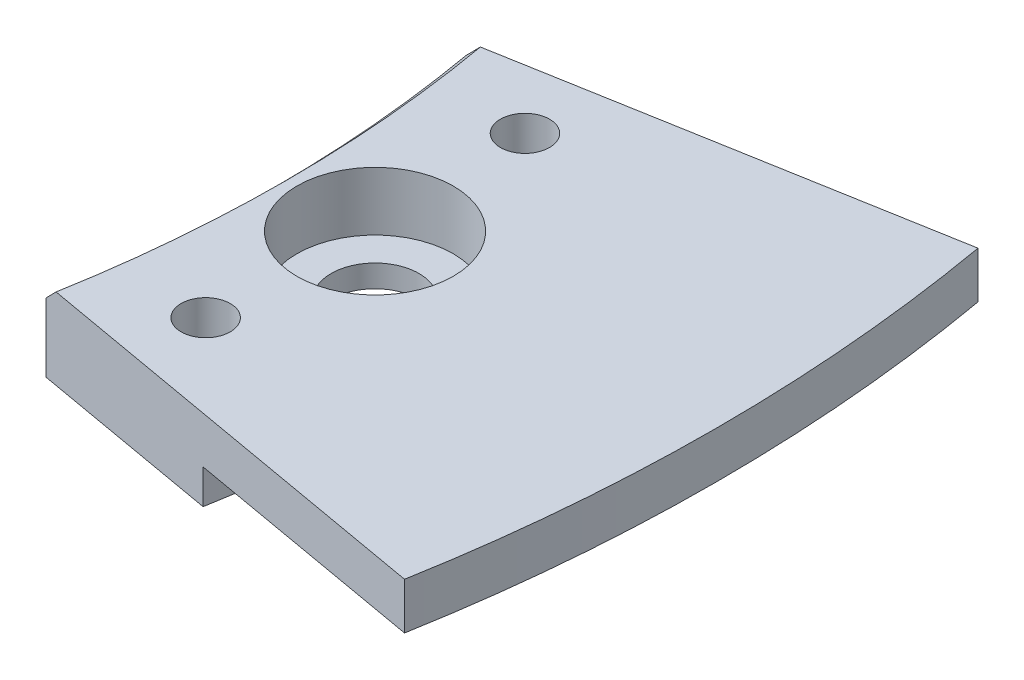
ISO-10303-21;
HEADER;
FILE_DESCRIPTION(('STEP AP214'),'2;1');
FILE_NAME('part.step','',(''),(''),'','','');
FILE_SCHEMA(('AUTOMOTIVE_DESIGN { 1 0 10303 214 1 1 1 1 }'));
ENDSEC;
DATA;
#1=APPLICATION_CONTEXT('core data for automotive mechanical design processes');
#2=APPLICATION_PROTOCOL_DEFINITION('international standard','automotive_design',2000,#1);
#3=PRODUCT_CONTEXT('',#1,'mechanical');
#4=PRODUCT('Part','Part','',(#3));
#5=PRODUCT_RELATED_PRODUCT_CATEGORY('part','',(#4));
#6=PRODUCT_DEFINITION_FORMATION('','',#4);
#7=PRODUCT_DEFINITION_CONTEXT('part definition',#1,'design');
#8=PRODUCT_DEFINITION('design','',#6,#7);
#9=PRODUCT_DEFINITION_SHAPE('','',#8);
#10=(LENGTH_UNIT() NAMED_UNIT(*) SI_UNIT(.MILLI.,.METRE.));
#11=(NAMED_UNIT(*) PLANE_ANGLE_UNIT() SI_UNIT($,.RADIAN.));
#12=(NAMED_UNIT(*) SI_UNIT($,.STERADIAN.) SOLID_ANGLE_UNIT());
#13=UNCERTAINTY_MEASURE_WITH_UNIT(LENGTH_MEASURE(1.E-05),#10,'distance_accuracy_value','');
#14=(GEOMETRIC_REPRESENTATION_CONTEXT(3) GLOBAL_UNCERTAINTY_ASSIGNED_CONTEXT((#13)) GLOBAL_UNIT_ASSIGNED_CONTEXT((#10,
#11,#12)) REPRESENTATION_CONTEXT('',''));
#15=CARTESIAN_POINT('',(0.,0.,0.));
#16=DIRECTION('',(0.,0.,1.));
#17=DIRECTION('',(1.,0.,0.));
#18=AXIS2_PLACEMENT_3D('',#15,#16,#17);
#19=CARTESIAN_POINT('',(60.9093747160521,0.,-10.739966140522));
#20=DIRECTION('',(0.,-1.,0.));
#21=DIRECTION('',(0.,0.,-1.));
#22=AXIS2_PLACEMENT_3D('',#19,#20,#21);
#23=PLANE('',#22);
#24=CARTESIAN_POINT('',(66.5005921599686,0.,8.1652460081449));
#25=DIRECTION('',(0.,1.,0.));
#26=DIRECTION('',(0.,0.,1.));
#27=AXIS2_PLACEMENT_3D('',#24,#25,#26);
#28=CIRCLE('',#27,1.25749999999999);
#29=CARTESIAN_POINT('',(66.5005921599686,0.,9.42274600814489));
#30=VERTEX_POINT('',#29);
#31=EDGE_CURVE('E110',#30,#30,#28,.T.);
#32=ORIENTED_EDGE('',*,*,#31,.T.);
#33=EDGE_LOOP('',(#32));
#34=FACE_BOUND('',#33,.T.);
#35=DIRECTION('',(0.984807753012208,0.,-0.173648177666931));
#36=VECTOR('',#35,1.);
#37=CARTESIAN_POINT('',(60.9093747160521,0.,-10.739966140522));
#38=LINE('',#37,#36);
#39=CARTESIAN_POINT('',(60.9093747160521,0.,-10.739966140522));
#40=VERTEX_POINT('',#39);
#41=CARTESIAN_POINT('',(70.664880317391,0.,-12.4601249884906));
#42=VERTEX_POINT('',#41);
#43=EDGE_CURVE('E140',#40,#42,#38,.T.);
#44=ORIENTED_EDGE('',*,*,#43,.T.);
#45=CARTESIAN_POINT('',(0.,0.,0.));
#46=DIRECTION('',(0.,-1.,0.));
#47=DIRECTION('',(0.,0.,-1.));
#48=AXIS2_PLACEMENT_3D('',#45,#46,#47);
#49=CIRCLE('',#48,71.755);
#50=CARTESIAN_POINT('',(70.664880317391,0.,12.4601249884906));
#51=VERTEX_POINT('',#50);
#52=EDGE_CURVE('E143',#42,#51,#49,.T.);
#53=ORIENTED_EDGE('',*,*,#52,.T.);
#54=DIRECTION('',(0.984807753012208,0.,0.173648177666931));
#55=VECTOR('',#54,1.);
#56=CARTESIAN_POINT('',(60.9093747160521,0.,10.739966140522));
#57=LINE('',#56,#55);
#58=CARTESIAN_POINT('',(60.9093747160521,0.,10.739966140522));
#59=VERTEX_POINT('',#58);
#60=EDGE_CURVE('E109',#59,#51,#57,.T.);
#61=ORIENTED_EDGE('',*,*,#60,.F.);
#62=CARTESIAN_POINT('',(0.,0.,0.));
#63=DIRECTION('',(0.,-1.,0.));
#64=DIRECTION('',(0.,0.,-1.));
#65=AXIS2_PLACEMENT_3D('',#62,#63,#64);
#66=CIRCLE('',#65,61.849);
#67=EDGE_CURVE('E145',#40,#59,#66,.T.);
#68=ORIENTED_EDGE('',*,*,#67,.F.);
#69=EDGE_LOOP('',(#44,#53,#61,#68));
#70=FACE_BOUND('',#69,.T.);
#71=CARTESIAN_POINT('',(66.5005921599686,0.,-8.1652460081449));
#72=DIRECTION('',(0.,-1.,0.));
#73=DIRECTION('',(0.,0.,-1.));
#74=AXIS2_PLACEMENT_3D('',#71,#72,#73);
#75=CIRCLE('',#74,1.25749999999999);
#76=CARTESIAN_POINT('',(66.5005921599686,0.,-9.42274600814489));
#77=VERTEX_POINT('',#76);
#78=EDGE_CURVE('E126',#77,#77,#75,.T.);
#79=ORIENTED_EDGE('',*,*,#78,.F.);
#80=EDGE_LOOP('',(#79));
#81=FACE_BOUND('',#80,.T.);
#82=CARTESIAN_POINT('',(67.,0.,0.));
#83=DIRECTION('',(0.,1.,0.));
#84=DIRECTION('',(0.,0.,1.));
#85=AXIS2_PLACEMENT_3D('',#82,#83,#84);
#86=CIRCLE('',#85,2.25);
#87=CARTESIAN_POINT('',(67.,0.,2.25));
#88=VERTEX_POINT('',#87);
#89=EDGE_CURVE('E314',#88,#88,#86,.T.);
#90=ORIENTED_EDGE('',*,*,#89,.T.);
#91=EDGE_LOOP('',(#90));
#92=FACE_BOUND('',#91,.T.);
#93=ADVANCED_FACE('F30',(#34,#70,#81,#92),#23,.T.);
#94=CARTESIAN_POINT('',(60.9093747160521,4.14325,-10.739966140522));
#95=DIRECTION('',(0.,1.,0.));
#96=DIRECTION('',(0.,0.,1.));
#97=AXIS2_PLACEMENT_3D('',#94,#95,#96);
#98=PLANE('',#97);
#99=CARTESIAN_POINT('',(67.,4.14325,0.));
#100=DIRECTION('',(0.,1.,0.));
#101=DIRECTION('',(0.,0.,1.));
#102=AXIS2_PLACEMENT_3D('',#99,#100,#101);
#103=CIRCLE('',#102,4.);
#104=CARTESIAN_POINT('',(67.,4.14325,4.));
#105=VERTEX_POINT('',#104);
#106=EDGE_CURVE('E323',#105,#105,#103,.T.);
#107=ORIENTED_EDGE('',*,*,#106,.F.);
#108=EDGE_LOOP('',(#107));
#109=FACE_BOUND('',#108,.T.);
#110=DIRECTION('',(-0.984807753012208,0.,0.173648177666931));
#111=VECTOR('',#110,1.);
#112=CARTESIAN_POINT('',(60.9093747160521,4.14325,-10.739966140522));
#113=LINE('',#112,#111);
#114=CARTESIAN_POINT('',(83.171938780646,4.14325,-14.6654568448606));
#115=VERTEX_POINT('',#114);
#116=CARTESIAN_POINT('',(61.5347276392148,4.14324999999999,-10.8502327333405));
#117=VERTEX_POINT('',#116);
#118=EDGE_CURVE('E135',#115,#117,#113,.T.);
#119=ORIENTED_EDGE('',*,*,#118,.T.);
#120=CARTESIAN_POINT('',(0.,4.14325,0.));
#121=DIRECTION('',(0.,1.,0.));
#122=DIRECTION('',(0.,0.,1.));
#123=AXIS2_PLACEMENT_3D('',#120,#121,#122);
#124=CIRCLE('',#123,62.484);
#125=CARTESIAN_POINT('',(61.5347276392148,4.14324999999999,10.8502327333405));
#126=VERTEX_POINT('',#125);
#127=EDGE_CURVE('E97',#117,#126,#124,.F.);
#128=ORIENTED_EDGE('',*,*,#127,.T.);
#129=DIRECTION('',(-0.984807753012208,0.,-0.173648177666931));
#130=VECTOR('',#129,1.);
#131=CARTESIAN_POINT('',(60.9093747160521,4.14325,10.739966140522));
#132=LINE('',#131,#130);
#133=CARTESIAN_POINT('',(83.171938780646,4.14325,14.6654568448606));
#134=VERTEX_POINT('',#133);
#135=EDGE_CURVE('E118',#134,#126,#132,.T.);
#136=ORIENTED_EDGE('',*,*,#135,.F.);
#137=CARTESIAN_POINT('',(0.,4.14325,0.));
#138=DIRECTION('',(0.,-1.,0.));
#139=DIRECTION('',(0.,0.,-1.));
#140=AXIS2_PLACEMENT_3D('',#137,#138,#139);
#141=CIRCLE('',#140,84.455);
#142=EDGE_CURVE('E148',#115,#134,#141,.T.);
#143=ORIENTED_EDGE('',*,*,#142,.F.);
#144=EDGE_LOOP('',(#119,#128,#136,#143));
#145=FACE_BOUND('',#144,.T.);
#146=CARTESIAN_POINT('',(66.5005921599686,4.14325,-8.1652460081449));
#147=DIRECTION('',(0.,-1.,0.));
#148=DIRECTION('',(0.,0.,-1.));
#149=AXIS2_PLACEMENT_3D('',#146,#147,#148);
#150=CIRCLE('',#149,1.25749999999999);
#151=CARTESIAN_POINT('',(66.5005921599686,4.14325,-9.42274600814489));
#152=VERTEX_POINT('',#151);
#153=EDGE_CURVE('E123',#152,#152,#150,.T.);
#154=ORIENTED_EDGE('',*,*,#153,.T.);
#155=EDGE_LOOP('',(#154));
#156=FACE_BOUND('',#155,.T.);
#157=CARTESIAN_POINT('',(66.5005921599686,4.14325,8.1652460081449));
#158=DIRECTION('',(0.,1.,0.));
#159=DIRECTION('',(0.,0.,1.));
#160=AXIS2_PLACEMENT_3D('',#157,#158,#159);
#161=CIRCLE('',#160,1.25749999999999);
#162=CARTESIAN_POINT('',(66.5005921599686,4.14325,9.42274600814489));
#163=VERTEX_POINT('',#162);
#164=EDGE_CURVE('E113',#163,#163,#161,.T.);
#165=ORIENTED_EDGE('',*,*,#164,.F.);
#166=EDGE_LOOP('',(#165));
#167=FACE_BOUND('',#166,.T.);
#168=ADVANCED_FACE('F156',(#109,#145,#156,#167),#98,.T.);
#169=CARTESIAN_POINT('',(0.,0.,0.));
#170=DIRECTION('',(0.,-1.,0.));
#171=DIRECTION('',(0.,0.,-1.));
#172=AXIS2_PLACEMENT_3D('',#169,#170,#171);
#173=CYLINDRICAL_SURFACE('',#172,71.755);
#174=CARTESIAN_POINT('',(0.,1.762,0.));
#175=DIRECTION('',(0.,-1.,0.));
#176=DIRECTION('',(0.,0.,-1.));
#177=AXIS2_PLACEMENT_3D('',#174,#175,#176);
#178=CIRCLE('',#177,71.755);
#179=CARTESIAN_POINT('',(70.664880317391,1.762,-12.4601249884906));
#180=VERTEX_POINT('',#179);
#181=CARTESIAN_POINT('',(70.664880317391,1.762,12.4601249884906));
#182=VERTEX_POINT('',#181);
#183=EDGE_CURVE('E87',#180,#182,#178,.T.);
#184=ORIENTED_EDGE('',*,*,#183,.T.);
#185=DIRECTION('',(0.,1.,0.));
#186=VECTOR('',#185,1.);
#187=CARTESIAN_POINT('',(70.664880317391,1.762,12.4601249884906));
#188=LINE('',#187,#186);
#189=EDGE_CURVE('E91',#51,#182,#188,.T.);
#190=ORIENTED_EDGE('',*,*,#189,.F.);
#191=ORIENTED_EDGE('',*,*,#52,.F.);
#192=DIRECTION('',(0.,1.,0.));
#193=VECTOR('',#192,1.);
#194=CARTESIAN_POINT('',(70.664880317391,1.762,-12.4601249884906));
#195=LINE('',#194,#193);
#196=EDGE_CURVE('E93',#42,#180,#195,.T.);
#197=ORIENTED_EDGE('',*,*,#196,.T.);
#198=EDGE_LOOP('',(#184,#190,#191,#197));
#199=FACE_BOUND('',#198,.T.);
#200=ADVANCED_FACE('F89',(#199),#173,.T.);
#201=CARTESIAN_POINT('',(70.664880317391,1.762,-12.4601249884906));
#202=DIRECTION('',(0.,-1.,0.));
#203=DIRECTION('',(0.,0.,-1.));
#204=AXIS2_PLACEMENT_3D('',#201,#202,#203);
#205=PLANE('',#204);
#206=CARTESIAN_POINT('',(0.,1.762,0.));
#207=DIRECTION('',(0.,-1.,0.));
#208=DIRECTION('',(0.,0.,-1.));
#209=AXIS2_PLACEMENT_3D('',#206,#207,#208);
#210=CIRCLE('',#209,84.455);
#211=CARTESIAN_POINT('',(83.171938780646,1.762,-14.6654568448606));
#212=VERTEX_POINT('',#211);
#213=CARTESIAN_POINT('',(83.171938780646,1.762,14.6654568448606));
#214=VERTEX_POINT('',#213);
#215=EDGE_CURVE('E98',#212,#214,#210,.T.);
#216=ORIENTED_EDGE('',*,*,#215,.T.);
#217=DIRECTION('',(0.984807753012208,0.,0.173648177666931));
#218=VECTOR('',#217,1.);
#219=CARTESIAN_POINT('',(70.664880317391,1.762,12.4601249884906));
#220=LINE('',#219,#218);
#221=EDGE_CURVE('E101',#182,#214,#220,.T.);
#222=ORIENTED_EDGE('',*,*,#221,.F.);
#223=ORIENTED_EDGE('',*,*,#183,.F.);
#224=DIRECTION('',(0.984807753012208,0.,-0.173648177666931));
#225=VECTOR('',#224,1.);
#226=CARTESIAN_POINT('',(70.664880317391,1.762,-12.4601249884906));
#227=LINE('',#226,#225);
#228=EDGE_CURVE('E130',#180,#212,#227,.T.);
#229=ORIENTED_EDGE('',*,*,#228,.T.);
#230=EDGE_LOOP('',(#216,#222,#223,#229));
#231=FACE_BOUND('',#230,.T.);
#232=ADVANCED_FACE('F32',(#231),#205,.T.);
#233=CARTESIAN_POINT('',(0.,0.,0.));
#234=DIRECTION('',(0.,-1.,0.));
#235=DIRECTION('',(0.,0.,-1.));
#236=AXIS2_PLACEMENT_3D('',#233,#234,#235);
#237=CYLINDRICAL_SURFACE('',#236,84.455);
#238=ORIENTED_EDGE('',*,*,#142,.T.);
#239=DIRECTION('',(0.,1.,0.));
#240=VECTOR('',#239,1.);
#241=CARTESIAN_POINT('',(83.171938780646,1.762,14.6654568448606));
#242=LINE('',#241,#240);
#243=EDGE_CURVE('E104',#214,#134,#242,.T.);
#244=ORIENTED_EDGE('',*,*,#243,.F.);
#245=ORIENTED_EDGE('',*,*,#215,.F.);
#246=DIRECTION('',(0.,1.,0.));
#247=VECTOR('',#246,1.);
#248=CARTESIAN_POINT('',(83.171938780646,1.762,-14.6654568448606));
#249=LINE('',#248,#247);
#250=EDGE_CURVE('E132',#212,#115,#249,.T.);
#251=ORIENTED_EDGE('',*,*,#250,.T.);
#252=EDGE_LOOP('',(#238,#244,#245,#251));
#253=FACE_BOUND('',#252,.T.);
#254=ADVANCED_FACE('F162',(#253),#237,.T.);
#255=CARTESIAN_POINT('',(0.,0.,0.));
#256=DIRECTION('',(0.,-1.,0.));
#257=DIRECTION('',(0.,0.,-1.));
#258=AXIS2_PLACEMENT_3D('',#255,#256,#257);
#259=CYLINDRICAL_SURFACE('',#258,61.849);
#260=DIRECTION('',(0.,-1.,0.));
#261=VECTOR('',#260,1.);
#262=CARTESIAN_POINT('',(60.9093747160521,4.14325,10.739966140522));
#263=LINE('',#262,#261);
#264=CARTESIAN_POINT('',(60.9093747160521,3.50824999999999,10.739966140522));
#265=VERTEX_POINT('',#264);
#266=EDGE_CURVE('E120',#265,#59,#263,.T.);
#267=ORIENTED_EDGE('',*,*,#266,.F.);
#268=CARTESIAN_POINT('',(0.,3.50824999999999,0.));
#269=DIRECTION('',(0.,1.,0.));
#270=DIRECTION('',(0.,0.,1.));
#271=AXIS2_PLACEMENT_3D('',#268,#269,#270);
#272=CIRCLE('',#271,61.849);
#273=CARTESIAN_POINT('',(60.909374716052,3.50824999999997,-10.739966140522));
#274=VERTEX_POINT('',#273);
#275=EDGE_CURVE('E38',#265,#274,#272,.T.);
#276=ORIENTED_EDGE('',*,*,#275,.T.);
#277=DIRECTION('',(0.,-1.,0.));
#278=VECTOR('',#277,1.);
#279=CARTESIAN_POINT('',(60.9093747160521,4.14325,-10.739966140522));
#280=LINE('',#279,#278);
#281=EDGE_CURVE('E138',#274,#40,#280,.T.);
#282=ORIENTED_EDGE('',*,*,#281,.T.);
#283=ORIENTED_EDGE('',*,*,#67,.T.);
#284=EDGE_LOOP('',(#267,#276,#282,#283));
#285=FACE_BOUND('',#284,.T.);
#286=ADVANCED_FACE('F189',(#285),#259,.F.);
#287=CARTESIAN_POINT('',(70.664880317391,0.,-12.4601249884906));
#288=DIRECTION('',(0.173648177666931,0.,0.984807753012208));
#289=DIRECTION('',(0.984807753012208,0.,-0.173648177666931));
#290=AXIS2_PLACEMENT_3D('',#287,#288,#289);
#291=PLANE('',#290);
#292=ORIENTED_EDGE('',*,*,#281,.F.);
#293=DIRECTION('',(0.696364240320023,0.707106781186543,-0.122787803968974));
#294=VECTOR('',#293,1.);
#295=CARTESIAN_POINT('',(0.,-58.3407499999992,0.));
#296=LINE('',#295,#294);
#297=EDGE_CURVE('E11',#274,#117,#296,.T.);
#298=ORIENTED_EDGE('',*,*,#297,.T.);
#299=ORIENTED_EDGE('',*,*,#118,.F.);
#300=ORIENTED_EDGE('',*,*,#250,.F.);
#301=ORIENTED_EDGE('',*,*,#228,.F.);
#302=ORIENTED_EDGE('',*,*,#196,.F.);
#303=ORIENTED_EDGE('',*,*,#43,.F.);
#304=EDGE_LOOP('',(#292,#298,#299,#300,#301,#302,#303));
#305=FACE_BOUND('',#304,.T.);
#306=ADVANCED_FACE('F165',(#305),#291,.F.);
#307=CARTESIAN_POINT('',(66.5005921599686,0.,-8.1652460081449));
#308=DIRECTION('',(0.,-1.,0.));
#309=DIRECTION('',(0.,0.,-1.));
#310=AXIS2_PLACEMENT_3D('',#307,#308,#309);
#311=CYLINDRICAL_SURFACE('',#310,1.25749999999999);
#312=ORIENTED_EDGE('',*,*,#153,.F.);
#313=EDGE_LOOP('',(#312));
#314=FACE_BOUND('',#313,.T.);
#315=ORIENTED_EDGE('',*,*,#78,.T.);
#316=EDGE_LOOP('',(#315));
#317=FACE_BOUND('',#316,.T.);
#318=ADVANCED_FACE('F229',(#314,#317),#311,.F.);
#319=CARTESIAN_POINT('',(70.664880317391,0.,12.4601249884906));
#320=DIRECTION('',(0.173648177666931,0.,-0.984807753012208));
#321=DIRECTION('',(0.984807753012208,0.,0.173648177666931));
#322=AXIS2_PLACEMENT_3D('',#319,#320,#321);
#323=PLANE('',#322);
#324=ORIENTED_EDGE('',*,*,#135,.T.);
#325=DIRECTION('',(-0.696364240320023,-0.707106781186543,-0.122787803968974));
#326=VECTOR('',#325,1.);
#327=CARTESIAN_POINT('',(0.,-58.3407499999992,0.));
#328=LINE('',#327,#326);
#329=EDGE_CURVE('E52',#126,#265,#328,.T.);
#330=ORIENTED_EDGE('',*,*,#329,.T.);
#331=ORIENTED_EDGE('',*,*,#266,.T.);
#332=ORIENTED_EDGE('',*,*,#60,.T.);
#333=ORIENTED_EDGE('',*,*,#189,.T.);
#334=ORIENTED_EDGE('',*,*,#221,.T.);
#335=ORIENTED_EDGE('',*,*,#243,.T.);
#336=EDGE_LOOP('',(#324,#330,#331,#332,#333,#334,#335));
#337=FACE_BOUND('',#336,.T.);
#338=ADVANCED_FACE('F107',(#337),#323,.F.);
#339=CARTESIAN_POINT('',(66.5005921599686,0.,8.1652460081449));
#340=DIRECTION('',(0.,-1.,0.));
#341=DIRECTION('',(0.,0.,1.));
#342=AXIS2_PLACEMENT_3D('',#339,#340,#341);
#343=CYLINDRICAL_SURFACE('',#342,1.25749999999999);
#344=ORIENTED_EDGE('',*,*,#164,.T.);
#345=EDGE_LOOP('',(#344));
#346=FACE_BOUND('',#345,.T.);
#347=ORIENTED_EDGE('',*,*,#31,.F.);
#348=EDGE_LOOP('',(#347));
#349=FACE_BOUND('',#348,.T.);
#350=ADVANCED_FACE('F236',(#346,#349),#343,.F.);
#351=CARTESIAN_POINT('',(67.,4.14325,0.));
#352=DIRECTION('',(0.,1.,0.));
#353=DIRECTION('',(0.,0.,1.));
#354=AXIS2_PLACEMENT_3D('',#351,#352,#353);
#355=CYLINDRICAL_SURFACE('',#354,4.);
#356=CARTESIAN_POINT('',(67.,1.14325,0.));
#357=DIRECTION('',(0.,1.,0.));
#358=DIRECTION('',(0.,0.,1.));
#359=AXIS2_PLACEMENT_3D('',#356,#357,#358);
#360=CIRCLE('',#359,4.);
#361=CARTESIAN_POINT('',(67.,1.14325,4.));
#362=VERTEX_POINT('',#361);
#363=EDGE_CURVE('E318',#362,#362,#360,.T.);
#364=ORIENTED_EDGE('',*,*,#363,.F.);
#365=EDGE_LOOP('',(#364));
#366=FACE_BOUND('',#365,.T.);
#367=ORIENTED_EDGE('',*,*,#106,.T.);
#368=EDGE_LOOP('',(#367));
#369=FACE_BOUND('',#368,.T.);
#370=ADVANCED_FACE('F254',(#366,#369),#355,.F.);
#371=CARTESIAN_POINT('',(69.25,1.14325,0.));
#372=DIRECTION('',(0.,-1.,0.));
#373=DIRECTION('',(0.,0.,-1.));
#374=AXIS2_PLACEMENT_3D('',#371,#372,#373);
#375=PLANE('',#374);
#376=CARTESIAN_POINT('',(67.,1.14325,0.));
#377=DIRECTION('',(0.,1.,0.));
#378=DIRECTION('',(0.,0.,1.));
#379=AXIS2_PLACEMENT_3D('',#376,#377,#378);
#380=CIRCLE('',#379,2.25);
#381=CARTESIAN_POINT('',(67.,1.14325,2.25));
#382=VERTEX_POINT('',#381);
#383=EDGE_CURVE('E315',#382,#382,#380,.T.);
#384=ORIENTED_EDGE('',*,*,#383,.F.);
#385=EDGE_LOOP('',(#384));
#386=FACE_BOUND('',#385,.T.);
#387=ORIENTED_EDGE('',*,*,#363,.T.);
#388=EDGE_LOOP('',(#387));
#389=FACE_BOUND('',#388,.T.);
#390=ADVANCED_FACE('F174',(#386,#389),#375,.F.);
#391=CARTESIAN_POINT('',(67.,4.14325,0.));
#392=DIRECTION('',(0.,1.,0.));
#393=DIRECTION('',(0.,0.,1.));
#394=AXIS2_PLACEMENT_3D('',#391,#392,#393);
#395=CYLINDRICAL_SURFACE('',#394,2.25);
#396=ORIENTED_EDGE('',*,*,#89,.F.);
#397=EDGE_LOOP('',(#396));
#398=FACE_BOUND('',#397,.T.);
#399=ORIENTED_EDGE('',*,*,#383,.T.);
#400=EDGE_LOOP('',(#399));
#401=FACE_BOUND('',#400,.T.);
#402=ADVANCED_FACE('F169',(#398,#401),#395,.F.);
#403=CARTESIAN_POINT('',(0.,4.14325,0.));
#404=DIRECTION('',(0.,1.,0.));
#405=DIRECTION('',(0.,0.,1.));
#406=AXIS2_PLACEMENT_3D('',#403,#404,#405);
#407=CONICAL_SURFACE('',#406,62.484,0.785398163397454);
#408=ORIENTED_EDGE('',*,*,#297,.F.);
#409=ORIENTED_EDGE('',*,*,#275,.F.);
#410=ORIENTED_EDGE('',*,*,#329,.F.);
#411=ORIENTED_EDGE('',*,*,#127,.F.);
#412=EDGE_LOOP('',(#408,#409,#410,#411));
#413=FACE_BOUND('',#412,.T.);
#414=ADVANCED_FACE('F167',(#413),#407,.F.);
#415=CLOSED_SHELL('',(#93,#168,#200,#232,#254,#286,#306,#318,#338,#350,#370,#390,#402,#414));
#416=MANIFOLD_SOLID_BREP('B2',#415);
#417=ADVANCED_BREP_SHAPE_REPRESENTATION('',(#18,#416),#14);
#418=SHAPE_DEFINITION_REPRESENTATION(#9,#417);
ENDSEC;
END-ISO-10303-21;
